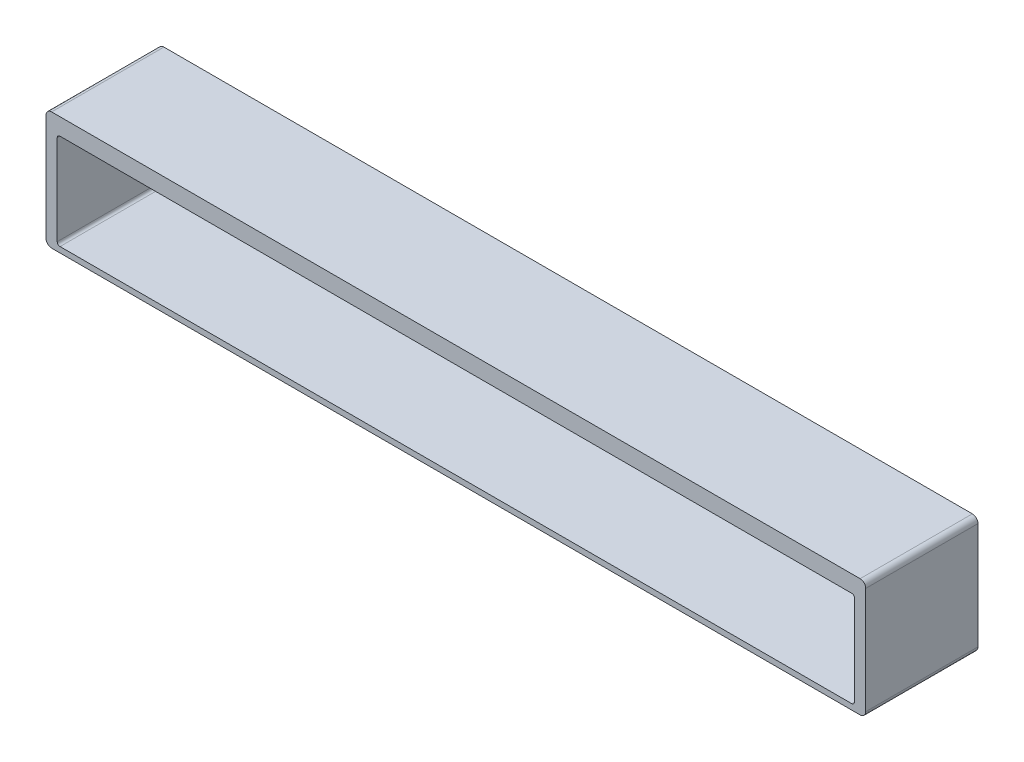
from build123d import *

# Parameters (mm, degrees)
SKIZZE17_W                      = 67
SKIZZE17_H                      = 1.5
LINEAR_AUSTRAGEN1_DEPTH         = 86.381151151
SKIZZE19_W                      = 1
SKIZZE19_H                      = 10.509377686
LINEAR_AUSTRAGEN2_DEPTH         = 67
SKIZZE23_W                      = 87.381151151
SKIZZE23_H                      = 1.5
LINEAR_AUSTRAGEN3_DEPTH         = 2
SKIZZE24_W                      = 87.381151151
SKIZZE24_H                      = 1.5
LINEAR_AUSTRAGEN4_DEPTH         = 2
SKIZZE25_W                      = 2
SKIZZE25_H                      = 1
LINEAR_AUSTRAGEN5_DEPTH         = 9.009377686
SKIZZE26_W                      = 2
SKIZZE26_H                      = 1
LINEAR_AUSTRAGEN6_DEPTH         = 9.009377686
SKIZZE27_W                      = 1
SKIZZE27_H                      = 87.381151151
LINEAR_AUSTRAGEN7_DEPTH         = 10.509377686
SKIZZE29_W                      = 1
SKIZZE29_H                      = 87.381151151
LINEAR_AUSTRAGEN8_DEPTH         = 10.509377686
SKIZZE36_W                      = 73
SKIZZE36_H                      = 0.5
LINEAR_AUSTRAGEN9_DEPTH         = 87.381151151
SKIZZE37_W                      = 80
SKIZZE37_H                      = 46.159833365
SCHNITT_LINEAR_AUSTRAGEN1_DEPTH = 125.920482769
VERRUNDUNG1_R                   = 0.25
VERRUNDUNG2_R                   = 0.5


with BuildPart() as part:
    # Skizze17 → Linear austragen1 (new body)
    with BuildSketch(Plane.XY.offset(-12.618848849)):
        with Locations((-54.709965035, -6.857692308)):
            Rectangle(SKIZZE17_W, SKIZZE17_H)
    extrude(amount=-LINEAR_AUSTRAGEN1_DEPTH)

    # Skizze19 → Linear austragen2 (add)
    with BuildSketch(Plane(origin=(-21.209965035, 0, 0), x_dir=(0, 0, -1), z_dir=(1, 0, 0))):
        with Locations((99.5, -11.362381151)):
            Rectangle(SKIZZE19_W, SKIZZE19_H)
    extrude(amount=-LINEAR_AUSTRAGEN2_DEPTH)

    # Skizze23 → Linear austragen3 (add)
    with BuildSketch(Plane.ZY.offset(90.209965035)):
        with Locations((-56.309424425, -6.857692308)):
            Rectangle(SKIZZE23_W, SKIZZE23_H)
    extrude(amount=-LINEAR_AUSTRAGEN3_DEPTH)

    # Skizze24 → Linear austragen4 (add)
    with BuildSketch(Plane(origin=(-19.209965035, 0, 0), x_dir=(0, 0, -1), z_dir=(1, 0, 0))):
        with Locations((56.309424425, -6.857692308)):
            Rectangle(SKIZZE24_W, SKIZZE24_H)
    extrude(amount=-LINEAR_AUSTRAGEN4_DEPTH)

    # Skizze25 → Linear austragen5 (add)
    with BuildSketch(Plane.XZ.offset(16.617069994)):
        with Locations((-20.209965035, -99.5)):
            Rectangle(SKIZZE25_W, SKIZZE25_H)
    extrude(amount=-LINEAR_AUSTRAGEN5_DEPTH)

    # Skizze26 → Linear austragen6 (add)
    with BuildSketch(Plane.XZ.offset(16.617069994)):
        with Locations((-89.209965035, -99.5)):
            Rectangle(SKIZZE26_W, SKIZZE26_H)
    extrude(amount=-LINEAR_AUSTRAGEN6_DEPTH)

    # Skizze27 → Linear austragen7 (add)
    with BuildSketch(Plane(origin=(0, -6.107692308, 0), x_dir=(1, 0, 0), z_dir=(0, 1, 0))):
        with Locations((-90.709965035, 56.309424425)):
            Rectangle(SKIZZE27_W, SKIZZE27_H)
    extrude(amount=-LINEAR_AUSTRAGEN7_DEPTH)

    # Skizze29 → Linear austragen8 (add)
    with BuildSketch(Plane(origin=(0, -6.107692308, 0), x_dir=(1, 0, 0), z_dir=(0, 1, 0))):
        with Locations((-18.709965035, 56.309424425)):
            Rectangle(SKIZZE29_W, SKIZZE29_H)
    extrude(amount=-LINEAR_AUSTRAGEN8_DEPTH)

    # Skizze36 → Linear austragen9 (add)
    with BuildSketch(Plane.XY.offset(-12.618848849)):
        with Locations((-54.709965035, -16.367069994)):
            Rectangle(SKIZZE36_W, SKIZZE36_H)
    extrude(amount=-LINEAR_AUSTRAGEN9_DEPTH)

    # Skizze37 → Schnitt-Linear austragen1 (cut, through all)
    with BuildSketch(Plane.ZY.offset(91.209965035)):
        with Locations((-50, -17.591014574)):
            Rectangle(SKIZZE37_W, SKIZZE37_H)
    extrude(amount=-SCHNITT_LINEAR_AUSTRAGEN1_DEPTH, mode=Mode.SUBTRACT)

    # Verrundung1
    verrundung1_edges = [part.edges().sort_by_distance(p)[0] for p in [
        (-19.209965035, -16.117069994, -94.5),
        (-90.209965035, -16.117069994, -94.5),
        (-90.209965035, -7.607692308, -94.5),
        (-19.209965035, -7.607692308, -94.5),
    ]]
    fillet(verrundung1_edges, radius=VERRUNDUNG1_R)

    # Verrundung2
    verrundung2_edges = [part.edges().sort_by_distance(p)[0] for p in [
        (-18.209965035, -6.107692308, -95),
        (-18.209965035, -16.617069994, -95),
        (-91.209965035, -6.107692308, -95),
        (-91.209965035, -16.617069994, -95),
    ]]
    fillet(verrundung2_edges, radius=VERRUNDUNG2_R)


solid = part.part
